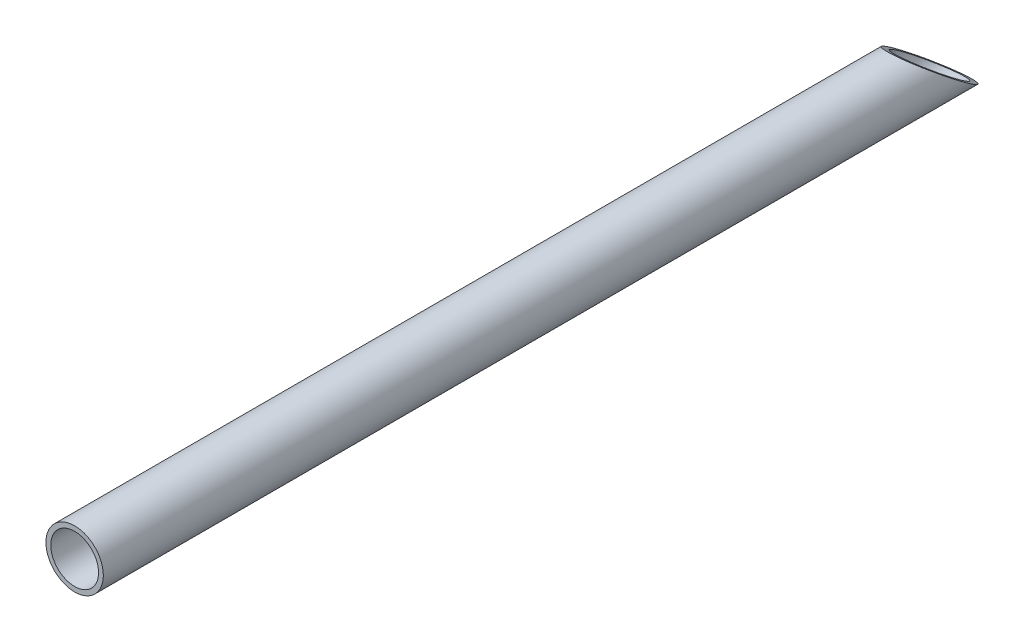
ISO-10303-21;
HEADER;
FILE_DESCRIPTION(('STEP AP214'),'2;1');
FILE_NAME('part.step','',(''),(''),'','','');
FILE_SCHEMA(('AUTOMOTIVE_DESIGN { 1 0 10303 214 1 1 1 1 }'));
ENDSEC;
DATA;
#1=APPLICATION_CONTEXT('core data for automotive mechanical design processes');
#2=APPLICATION_PROTOCOL_DEFINITION('international standard','automotive_design',2000,#1);
#3=PRODUCT_CONTEXT('',#1,'mechanical');
#4=PRODUCT('Part','Part','',(#3));
#5=PRODUCT_RELATED_PRODUCT_CATEGORY('part','',(#4));
#6=PRODUCT_DEFINITION_FORMATION('','',#4);
#7=PRODUCT_DEFINITION_CONTEXT('part definition',#1,'design');
#8=PRODUCT_DEFINITION('design','',#6,#7);
#9=PRODUCT_DEFINITION_SHAPE('','',#8);
#10=(LENGTH_UNIT() NAMED_UNIT(*) SI_UNIT(.MILLI.,.METRE.));
#11=(NAMED_UNIT(*) PLANE_ANGLE_UNIT() SI_UNIT($,.RADIAN.));
#12=(NAMED_UNIT(*) SI_UNIT($,.STERADIAN.) SOLID_ANGLE_UNIT());
#13=UNCERTAINTY_MEASURE_WITH_UNIT(LENGTH_MEASURE(1.E-05),#10,'distance_accuracy_value','');
#14=(GEOMETRIC_REPRESENTATION_CONTEXT(3) GLOBAL_UNCERTAINTY_ASSIGNED_CONTEXT((#13)) GLOBAL_UNIT_ASSIGNED_CONTEXT((#10,
#11,#12)) REPRESENTATION_CONTEXT('',''));
#15=CARTESIAN_POINT('',(0.,0.,0.));
#16=DIRECTION('',(0.,0.,1.));
#17=DIRECTION('',(1.,0.,0.));
#18=AXIS2_PLACEMENT_3D('',#15,#16,#17);
#19=CARTESIAN_POINT('',(0.,0.,-1000.));
#20=DIRECTION('',(0.,0.,1.));
#21=DIRECTION('',(1.,0.,0.));
#22=AXIS2_PLACEMENT_3D('',#19,#20,#21);
#23=CYLINDRICAL_SURFACE('',#22,30.);
#24=CARTESIAN_POINT('',(0.,0.,0.));
#25=DIRECTION('',(0.,0.,1.));
#26=DIRECTION('',(1.,0.,0.));
#27=AXIS2_PLACEMENT_3D('',#24,#25,#26);
#28=CIRCLE('',#27,30.);
#29=CARTESIAN_POINT('',(30.,0.,0.));
#30=VERTEX_POINT('',#29);
#31=EDGE_CURVE('E41',#30,#30,#28,.T.);
#32=ORIENTED_EDGE('',*,*,#31,.F.);
#33=EDGE_LOOP('',(#32));
#34=FACE_BOUND('',#33,.T.);
#35=CARTESIAN_POINT('',(0.,0.,-893.802897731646));
#36=DIRECTION('',(-0.0319889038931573,0.797290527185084,-0.602747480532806));
#37=DIRECTION('',(-0.0241640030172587,0.602262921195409,0.797931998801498));
#38=AXIS2_PLACEMENT_3D('',#35,#36,#37);
#39=ELLIPSE('',#38,49.7720869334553,30.);
#40=CARTESIAN_POINT('',(-1.20269285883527,29.9758824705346,-854.088156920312));
#41=VERTEX_POINT('',#40);
#42=EDGE_CURVE('E49',#41,#41,#39,.F.);
#43=ORIENTED_EDGE('',*,*,#42,.T.);
#44=EDGE_LOOP('',(#43));
#45=FACE_BOUND('',#44,.T.);
#46=ADVANCED_FACE('F35',(#34,#45),#23,.T.);
#47=CARTESIAN_POINT('',(0.,0.,-1000.));
#48=DIRECTION('',(0.,0.,1.));
#49=DIRECTION('',(1.,0.,0.));
#50=AXIS2_PLACEMENT_3D('',#47,#48,#49);
#51=CYLINDRICAL_SURFACE('',#50,25.);
#52=CARTESIAN_POINT('',(0.,0.,0.));
#53=DIRECTION('',(0.,0.,1.));
#54=DIRECTION('',(1.,0.,0.));
#55=AXIS2_PLACEMENT_3D('',#52,#53,#54);
#56=CIRCLE('',#55,25.);
#57=CARTESIAN_POINT('',(25.,0.,0.));
#58=VERTEX_POINT('',#57);
#59=EDGE_CURVE('E45',#58,#58,#56,.T.);
#60=ORIENTED_EDGE('',*,*,#59,.T.);
#61=EDGE_LOOP('',(#60));
#62=FACE_BOUND('',#61,.T.);
#63=CARTESIAN_POINT('',(0.,0.,-893.802897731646));
#64=DIRECTION('',(-0.0319889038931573,0.797290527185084,-0.602747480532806));
#65=DIRECTION('',(-0.0241640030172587,0.602262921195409,0.797931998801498));
#66=AXIS2_PLACEMENT_3D('',#63,#64,#65);
#67=ELLIPSE('',#66,41.4767391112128,25.);
#68=CARTESIAN_POINT('',(-1.0022440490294,24.9799020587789,-860.707280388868));
#69=VERTEX_POINT('',#68);
#70=EDGE_CURVE('E11',#69,#69,#67,.F.);
#71=ORIENTED_EDGE('',*,*,#70,.F.);
#72=EDGE_LOOP('',(#71));
#73=FACE_BOUND('',#72,.T.);
#74=ADVANCED_FACE('F63',(#62,#73),#51,.F.);
#75=CARTESIAN_POINT('',(0.,0.,0.));
#76=DIRECTION('',(0.,0.,1.));
#77=DIRECTION('',(1.,0.,0.));
#78=AXIS2_PLACEMENT_3D('',#75,#76,#77);
#79=PLANE('',#78);
#80=ORIENTED_EDGE('',*,*,#59,.F.);
#81=EDGE_LOOP('',(#80));
#82=FACE_BOUND('',#81,.T.);
#83=ORIENTED_EDGE('',*,*,#31,.T.);
#84=EDGE_LOOP('',(#83));
#85=FACE_BOUND('',#84,.T.);
#86=ADVANCED_FACE('F58',(#82,#85),#79,.T.);
#87=CARTESIAN_POINT('',(-17.2336203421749,429.530261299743,-324.722637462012));
#88=DIRECTION('',(-0.0319889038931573,0.797290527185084,-0.602747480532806));
#89=DIRECTION('',(0.,0.603056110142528,0.797698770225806));
#90=AXIS2_PLACEMENT_3D('',#87,#88,#89);
#91=PLANE('',#90);
#92=ORIENTED_EDGE('',*,*,#42,.F.);
#93=EDGE_LOOP('',(#92));
#94=FACE_BOUND('',#93,.T.);
#95=ORIENTED_EDGE('',*,*,#70,.T.);
#96=EDGE_LOOP('',(#95));
#97=FACE_BOUND('',#96,.T.);
#98=ADVANCED_FACE('F56',(#94,#97),#91,.T.);
#99=CLOSED_SHELL('',(#46,#74,#86,#98));
#100=MANIFOLD_SOLID_BREP('B2',#99);
#101=ADVANCED_BREP_SHAPE_REPRESENTATION('',(#18,#100),#14);
#102=SHAPE_DEFINITION_REPRESENTATION(#9,#101);
ENDSEC;
END-ISO-10303-21;
